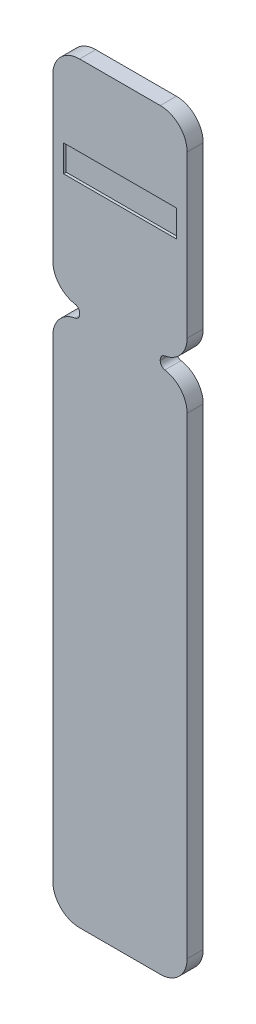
ISO-10303-21;
HEADER;
FILE_DESCRIPTION(('STEP AP214'),'2;1');
FILE_NAME('part.step','',(''),(''),'','','');
FILE_SCHEMA(('AUTOMOTIVE_DESIGN { 1 0 10303 214 1 1 1 1 }'));
ENDSEC;
DATA;
#1=APPLICATION_CONTEXT('core data for automotive mechanical design processes');
#2=APPLICATION_PROTOCOL_DEFINITION('international standard','automotive_design',2000,#1);
#3=PRODUCT_CONTEXT('',#1,'mechanical');
#4=PRODUCT('Part','Part','',(#3));
#5=PRODUCT_RELATED_PRODUCT_CATEGORY('part','',(#4));
#6=PRODUCT_DEFINITION_FORMATION('','',#4);
#7=PRODUCT_DEFINITION_CONTEXT('part definition',#1,'design');
#8=PRODUCT_DEFINITION('design','',#6,#7);
#9=PRODUCT_DEFINITION_SHAPE('','',#8);
#10=(LENGTH_UNIT() NAMED_UNIT(*) SI_UNIT(.MILLI.,.METRE.));
#11=(NAMED_UNIT(*) PLANE_ANGLE_UNIT() SI_UNIT($,.RADIAN.));
#12=(NAMED_UNIT(*) SI_UNIT($,.STERADIAN.) SOLID_ANGLE_UNIT());
#13=UNCERTAINTY_MEASURE_WITH_UNIT(LENGTH_MEASURE(1.E-05),#10,'distance_accuracy_value','');
#14=(GEOMETRIC_REPRESENTATION_CONTEXT(3) GLOBAL_UNCERTAINTY_ASSIGNED_CONTEXT((#13)) GLOBAL_UNIT_ASSIGNED_CONTEXT((#10,
#11,#12)) REPRESENTATION_CONTEXT('',''));
#15=CARTESIAN_POINT('',(0.,0.,0.));
#16=DIRECTION('',(0.,0.,1.));
#17=DIRECTION('',(1.,0.,0.));
#18=AXIS2_PLACEMENT_3D('',#15,#16,#17);
#19=CARTESIAN_POINT('',(-50.,60.,3.));
#20=DIRECTION('',(0.,-1.,0.));
#21=DIRECTION('',(0.,0.,-1.));
#22=AXIS2_PLACEMENT_3D('',#19,#20,#21);
#23=PLANE('',#22);
#24=DIRECTION('',(-1.,0.,0.));
#25=VECTOR('',#24,1.);
#26=CARTESIAN_POINT('',(-50.,60.,3.));
#27=LINE('',#26,#25);
#28=CARTESIAN_POINT('',(-30.,60.,3.));
#29=VERTEX_POINT('',#28);
#30=CARTESIAN_POINT('',(-45.,60.,3.));
#31=VERTEX_POINT('',#30);
#32=EDGE_CURVE('E249',#29,#31,#27,.T.);
#33=ORIENTED_EDGE('',*,*,#32,.F.);
#34=DIRECTION('',(0.,0.,-1.));
#35=VECTOR('',#34,1.);
#36=CARTESIAN_POINT('',(-30.,60.,3.));
#37=LINE('',#36,#35);
#38=CARTESIAN_POINT('',(-30.,60.,0.));
#39=VERTEX_POINT('',#38);
#40=EDGE_CURVE('E342',#29,#39,#37,.T.);
#41=ORIENTED_EDGE('',*,*,#40,.T.);
#42=DIRECTION('',(-1.,0.,0.));
#43=VECTOR('',#42,1.);
#44=CARTESIAN_POINT('',(-50.,60.,0.));
#45=LINE('',#44,#43);
#46=CARTESIAN_POINT('',(-45.,60.,0.));
#47=VERTEX_POINT('',#46);
#48=EDGE_CURVE('E225',#39,#47,#45,.T.);
#49=ORIENTED_EDGE('',*,*,#48,.T.);
#50=DIRECTION('',(0.,0.,-1.));
#51=VECTOR('',#50,1.);
#52=CARTESIAN_POINT('',(-45.,60.,3.));
#53=LINE('',#52,#51);
#54=EDGE_CURVE('E340',#47,#31,#53,.F.);
#55=ORIENTED_EDGE('',*,*,#54,.T.);
#56=EDGE_LOOP('',(#33,#41,#49,#55));
#57=FACE_BOUND('',#56,.T.);
#58=ADVANCED_FACE('F27',(#57),#23,.F.);
#59=CARTESIAN_POINT('',(-50.,60.,3.));
#60=DIRECTION('',(1.,0.,0.));
#61=DIRECTION('',(0.,1.,0.));
#62=AXIS2_PLACEMENT_3D('',#59,#60,#61);
#63=PLANE('',#62);
#64=DIRECTION('',(0.,-1.,0.));
#65=VECTOR('',#64,1.);
#66=CARTESIAN_POINT('',(-50.,60.,3.));
#67=LINE('',#66,#65);
#68=CARTESIAN_POINT('',(-50.,55.,3.));
#69=VERTEX_POINT('',#68);
#70=CARTESIAN_POINT('',(-50.,25.,3.));
#71=VERTEX_POINT('',#70);
#72=EDGE_CURVE('E252',#69,#71,#67,.T.);
#73=ORIENTED_EDGE('',*,*,#72,.F.);
#74=DIRECTION('',(0.,0.,-1.));
#75=VECTOR('',#74,1.);
#76=CARTESIAN_POINT('',(-50.,55.,3.));
#77=LINE('',#76,#75);
#78=CARTESIAN_POINT('',(-50.,55.,0.));
#79=VERTEX_POINT('',#78);
#80=EDGE_CURVE('E11',#69,#79,#77,.T.);
#81=ORIENTED_EDGE('',*,*,#80,.T.);
#82=DIRECTION('',(0.,-1.,0.));
#83=VECTOR('',#82,1.);
#84=CARTESIAN_POINT('',(-50.,60.,0.));
#85=LINE('',#84,#83);
#86=CARTESIAN_POINT('',(-50.,25.,0.));
#87=VERTEX_POINT('',#86);
#88=EDGE_CURVE('E230',#79,#87,#85,.T.);
#89=ORIENTED_EDGE('',*,*,#88,.T.);
#90=DIRECTION('',(0.,0.,-1.));
#91=VECTOR('',#90,1.);
#92=CARTESIAN_POINT('',(-50.,25.,3.));
#93=LINE('',#92,#91);
#94=EDGE_CURVE('E301',#87,#71,#93,.F.);
#95=ORIENTED_EDGE('',*,*,#94,.T.);
#96=EDGE_LOOP('',(#73,#81,#89,#95));
#97=FACE_BOUND('',#96,.T.);
#98=ADVANCED_FACE('F419',(#97),#63,.F.);
#99=CARTESIAN_POINT('',(-45.,20.,3.));
#100=DIRECTION('',(1.,0.,0.));
#101=DIRECTION('',(0.,0.,-1.));
#102=AXIS2_PLACEMENT_3D('',#99,#100,#101);
#103=PLANE('',#102);
#104=DIRECTION('',(0.,-1.,0.));
#105=VECTOR('',#104,1.);
#106=CARTESIAN_POINT('',(-45.,20.,0.));
#107=LINE('',#106,#105);
#108=CARTESIAN_POINT('',(-45.,19.0418123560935,0.));
#109=VERTEX_POINT('',#108);
#110=CARTESIAN_POINT('',(-45.,18.8581876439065,0.));
#111=VERTEX_POINT('',#110);
#112=EDGE_CURVE('E232',#109,#111,#107,.T.);
#113=ORIENTED_EDGE('',*,*,#112,.T.);
#114=DIRECTION('',(0.,0.,-1.));
#115=VECTOR('',#114,1.);
#116=CARTESIAN_POINT('',(-45.,18.8581876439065,3.));
#117=LINE('',#116,#115);
#118=CARTESIAN_POINT('',(-45.,18.8581876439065,3.));
#119=VERTEX_POINT('',#118);
#120=EDGE_CURVE('E320',#111,#119,#117,.F.);
#121=ORIENTED_EDGE('',*,*,#120,.T.);
#122=DIRECTION('',(0.,-1.,0.));
#123=VECTOR('',#122,1.);
#124=CARTESIAN_POINT('',(-45.,20.,3.));
#125=LINE('',#124,#123);
#126=CARTESIAN_POINT('',(-45.,19.0418123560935,3.));
#127=VERTEX_POINT('',#126);
#128=EDGE_CURVE('E254',#127,#119,#125,.T.);
#129=ORIENTED_EDGE('',*,*,#128,.F.);
#130=DIRECTION('',(0.,0.,-1.));
#131=VECTOR('',#130,1.);
#132=CARTESIAN_POINT('',(-45.,19.0418123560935,3.));
#133=LINE('',#132,#131);
#134=EDGE_CURVE('E317',#127,#109,#133,.T.);
#135=ORIENTED_EDGE('',*,*,#134,.T.);
#136=EDGE_LOOP('',(#113,#121,#129,#135));
#137=FACE_BOUND('',#136,.T.);
#138=ADVANCED_FACE('F434',(#137),#103,.F.);
#139=CARTESIAN_POINT('',(-50.,17.9,3.));
#140=DIRECTION('',(1.,0.,0.));
#141=DIRECTION('',(0.,0.,-1.));
#142=AXIS2_PLACEMENT_3D('',#139,#140,#141);
#143=PLANE('',#142);
#144=DIRECTION('',(0.,-1.,0.));
#145=VECTOR('',#144,1.);
#146=CARTESIAN_POINT('',(-50.,17.9,0.));
#147=LINE('',#146,#145);
#148=CARTESIAN_POINT('',(-50.,12.9,0.));
#149=VERTEX_POINT('',#148);
#150=CARTESIAN_POINT('',(-50.,-75.,0.));
#151=VERTEX_POINT('',#150);
#152=EDGE_CURVE('E235',#149,#151,#147,.T.);
#153=ORIENTED_EDGE('',*,*,#152,.T.);
#154=DIRECTION('',(0.,0.,-1.));
#155=VECTOR('',#154,1.);
#156=CARTESIAN_POINT('',(-50.,-75.,3.));
#157=LINE('',#156,#155);
#158=CARTESIAN_POINT('',(-50.,-75.,3.));
#159=VERTEX_POINT('',#158);
#160=EDGE_CURVE('E367',#151,#159,#157,.F.);
#161=ORIENTED_EDGE('',*,*,#160,.T.);
#162=DIRECTION('',(0.,-1.,0.));
#163=VECTOR('',#162,1.);
#164=CARTESIAN_POINT('',(-50.,17.9,3.));
#165=LINE('',#164,#163);
#166=CARTESIAN_POINT('',(-50.,12.9,3.));
#167=VERTEX_POINT('',#166);
#168=EDGE_CURVE('E257',#167,#159,#165,.T.);
#169=ORIENTED_EDGE('',*,*,#168,.F.);
#170=DIRECTION('',(0.,0.,-1.));
#171=VECTOR('',#170,1.);
#172=CARTESIAN_POINT('',(-50.,12.9,3.));
#173=LINE('',#172,#171);
#174=EDGE_CURVE('E298',#167,#149,#173,.T.);
#175=ORIENTED_EDGE('',*,*,#174,.T.);
#176=EDGE_LOOP('',(#153,#161,#169,#175));
#177=FACE_BOUND('',#176,.T.);
#178=ADVANCED_FACE('F448',(#177),#143,.F.);
#179=CARTESIAN_POINT('',(-50.,-80.,3.));
#180=DIRECTION('',(0.,1.,0.));
#181=DIRECTION('',(0.,0.,1.));
#182=AXIS2_PLACEMENT_3D('',#179,#180,#181);
#183=PLANE('',#182);
#184=DIRECTION('',(1.,0.,0.));
#185=VECTOR('',#184,1.);
#186=CARTESIAN_POINT('',(-50.,-80.,3.));
#187=LINE('',#186,#185);
#188=CARTESIAN_POINT('',(-45.,-80.,3.));
#189=VERTEX_POINT('',#188);
#190=CARTESIAN_POINT('',(-30.,-80.,3.));
#191=VERTEX_POINT('',#190);
#192=EDGE_CURVE('E260',#189,#191,#187,.T.);
#193=ORIENTED_EDGE('',*,*,#192,.F.);
#194=DIRECTION('',(0.,0.,-1.));
#195=VECTOR('',#194,1.);
#196=CARTESIAN_POINT('',(-45.,-80.,3.));
#197=LINE('',#196,#195);
#198=CARTESIAN_POINT('',(-45.,-80.,0.));
#199=VERTEX_POINT('',#198);
#200=EDGE_CURVE('E364',#189,#199,#197,.T.);
#201=ORIENTED_EDGE('',*,*,#200,.T.);
#202=DIRECTION('',(1.,0.,0.));
#203=VECTOR('',#202,1.);
#204=CARTESIAN_POINT('',(-50.,-80.,0.));
#205=LINE('',#204,#203);
#206=CARTESIAN_POINT('',(-30.,-80.,0.));
#207=VERTEX_POINT('',#206);
#208=EDGE_CURVE('E238',#199,#207,#205,.T.);
#209=ORIENTED_EDGE('',*,*,#208,.T.);
#210=DIRECTION('',(0.,0.,-1.));
#211=VECTOR('',#210,1.);
#212=CARTESIAN_POINT('',(-30.,-80.,3.));
#213=LINE('',#212,#211);
#214=EDGE_CURVE('E362',#207,#191,#213,.F.);
#215=ORIENTED_EDGE('',*,*,#214,.T.);
#216=EDGE_LOOP('',(#193,#201,#209,#215));
#217=FACE_BOUND('',#216,.T.);
#218=ADVANCED_FACE('F455',(#217),#183,.F.);
#219=CARTESIAN_POINT('',(-25.,17.9,3.));
#220=DIRECTION('',(-1.,0.,0.));
#221=DIRECTION('',(0.,-1.,0.));
#222=AXIS2_PLACEMENT_3D('',#219,#220,#221);
#223=PLANE('',#222);
#224=DIRECTION('',(0.,1.,0.));
#225=VECTOR('',#224,1.);
#226=CARTESIAN_POINT('',(-25.,17.9,3.));
#227=LINE('',#226,#225);
#228=CARTESIAN_POINT('',(-25.,-75.,3.));
#229=VERTEX_POINT('',#228);
#230=CARTESIAN_POINT('',(-25.,12.9,3.));
#231=VERTEX_POINT('',#230);
#232=EDGE_CURVE('E262',#229,#231,#227,.T.);
#233=ORIENTED_EDGE('',*,*,#232,.F.);
#234=DIRECTION('',(0.,0.,-1.));
#235=VECTOR('',#234,1.);
#236=CARTESIAN_POINT('',(-25.,-75.,3.));
#237=LINE('',#236,#235);
#238=CARTESIAN_POINT('',(-25.,-75.,0.));
#239=VERTEX_POINT('',#238);
#240=EDGE_CURVE('E34',#229,#239,#237,.T.);
#241=ORIENTED_EDGE('',*,*,#240,.T.);
#242=DIRECTION('',(0.,1.,0.));
#243=VECTOR('',#242,1.);
#244=CARTESIAN_POINT('',(-25.,17.9,0.));
#245=LINE('',#244,#243);
#246=CARTESIAN_POINT('',(-25.,12.9,0.));
#247=VERTEX_POINT('',#246);
#248=EDGE_CURVE('E241',#239,#247,#245,.T.);
#249=ORIENTED_EDGE('',*,*,#248,.T.);
#250=DIRECTION('',(0.,0.,-1.));
#251=VECTOR('',#250,1.);
#252=CARTESIAN_POINT('',(-25.,12.9,3.));
#253=LINE('',#252,#251);
#254=EDGE_CURVE('E295',#247,#231,#253,.F.);
#255=ORIENTED_EDGE('',*,*,#254,.T.);
#256=EDGE_LOOP('',(#233,#241,#249,#255));
#257=FACE_BOUND('',#256,.T.);
#258=ADVANCED_FACE('F372',(#257),#223,.F.);
#259=CARTESIAN_POINT('',(-30.,20.,3.));
#260=DIRECTION('',(-1.,0.,0.));
#261=DIRECTION('',(0.,0.,1.));
#262=AXIS2_PLACEMENT_3D('',#259,#260,#261);
#263=PLANE('',#262);
#264=DIRECTION('',(0.,1.,0.));
#265=VECTOR('',#264,1.);
#266=CARTESIAN_POINT('',(-30.,20.,3.));
#267=LINE('',#266,#265);
#268=CARTESIAN_POINT('',(-30.,18.8581876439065,3.));
#269=VERTEX_POINT('',#268);
#270=CARTESIAN_POINT('',(-30.,19.0418123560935,3.));
#271=VERTEX_POINT('',#270);
#272=EDGE_CURVE('E264',#269,#271,#267,.T.);
#273=ORIENTED_EDGE('',*,*,#272,.F.);
#274=DIRECTION('',(0.,0.,-1.));
#275=VECTOR('',#274,1.);
#276=CARTESIAN_POINT('',(-30.,18.8581876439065,3.));
#277=LINE('',#276,#275);
#278=CARTESIAN_POINT('',(-30.,18.8581876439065,0.));
#279=VERTEX_POINT('',#278);
#280=EDGE_CURVE('E306',#269,#279,#277,.T.);
#281=ORIENTED_EDGE('',*,*,#280,.T.);
#282=DIRECTION('',(0.,1.,0.));
#283=VECTOR('',#282,1.);
#284=CARTESIAN_POINT('',(-30.,20.,0.));
#285=LINE('',#284,#283);
#286=CARTESIAN_POINT('',(-30.,19.0418123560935,0.));
#287=VERTEX_POINT('',#286);
#288=EDGE_CURVE('E243',#279,#287,#285,.T.);
#289=ORIENTED_EDGE('',*,*,#288,.T.);
#290=DIRECTION('',(0.,0.,-1.));
#291=VECTOR('',#290,1.);
#292=CARTESIAN_POINT('',(-30.,19.0418123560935,3.));
#293=LINE('',#292,#291);
#294=EDGE_CURVE('E304',#287,#271,#293,.F.);
#295=ORIENTED_EDGE('',*,*,#294,.T.);
#296=EDGE_LOOP('',(#273,#281,#289,#295));
#297=FACE_BOUND('',#296,.T.);
#298=ADVANCED_FACE('F391',(#297),#263,.F.);
#299=CARTESIAN_POINT('',(-25.,60.,3.));
#300=DIRECTION('',(-1.,0.,0.));
#301=DIRECTION('',(0.,-1.,0.));
#302=AXIS2_PLACEMENT_3D('',#299,#300,#301);
#303=PLANE('',#302);
#304=DIRECTION('',(0.,1.,0.));
#305=VECTOR('',#304,1.);
#306=CARTESIAN_POINT('',(-25.,60.,0.));
#307=LINE('',#306,#305);
#308=CARTESIAN_POINT('',(-25.,25.,0.));
#309=VERTEX_POINT('',#308);
#310=CARTESIAN_POINT('',(-25.,55.,0.));
#311=VERTEX_POINT('',#310);
#312=EDGE_CURVE('E246',#309,#311,#307,.T.);
#313=ORIENTED_EDGE('',*,*,#312,.T.);
#314=DIRECTION('',(0.,0.,-1.));
#315=VECTOR('',#314,1.);
#316=CARTESIAN_POINT('',(-25.,55.,3.));
#317=LINE('',#316,#315);
#318=CARTESIAN_POINT('',(-25.,55.,3.));
#319=VERTEX_POINT('',#318);
#320=EDGE_CURVE('E353',#311,#319,#317,.F.);
#321=ORIENTED_EDGE('',*,*,#320,.T.);
#322=DIRECTION('',(0.,1.,0.));
#323=VECTOR('',#322,1.);
#324=CARTESIAN_POINT('',(-25.,60.,3.));
#325=LINE('',#324,#323);
#326=CARTESIAN_POINT('',(-25.,25.,3.));
#327=VERTEX_POINT('',#326);
#328=EDGE_CURVE('E267',#327,#319,#325,.T.);
#329=ORIENTED_EDGE('',*,*,#328,.F.);
#330=DIRECTION('',(0.,0.,-1.));
#331=VECTOR('',#330,1.);
#332=CARTESIAN_POINT('',(-25.,25.,3.));
#333=LINE('',#332,#331);
#334=EDGE_CURVE('E270',#327,#309,#333,.T.);
#335=ORIENTED_EDGE('',*,*,#334,.T.);
#336=EDGE_LOOP('',(#313,#321,#329,#335));
#337=FACE_BOUND('',#336,.T.);
#338=ADVANCED_FACE('F405',(#337),#303,.F.);
#339=CARTESIAN_POINT('',(-30.,60.,3.));
#340=DIRECTION('',(0.,0.,-1.));
#341=DIRECTION('',(-1.,0.,0.));
#342=AXIS2_PLACEMENT_3D('',#339,#340,#341);
#343=PLANE('',#342);
#344=DIRECTION('',(1.,0.,0.));
#345=VECTOR('',#344,1.);
#346=CARTESIAN_POINT('',(-48.,40.,3.));
#347=LINE('',#346,#345);
#348=CARTESIAN_POINT('',(-48.,40.,3.));
#349=VERTEX_POINT('',#348);
#350=CARTESIAN_POINT('',(-27.,40.,3.));
#351=VERTEX_POINT('',#350);
#352=EDGE_CURVE('E203',#349,#351,#347,.T.);
#353=ORIENTED_EDGE('',*,*,#352,.F.);
#354=DIRECTION('',(0.,-1.,0.));
#355=VECTOR('',#354,1.);
#356=CARTESIAN_POINT('',(-48.,45.,3.));
#357=LINE('',#356,#355);
#358=CARTESIAN_POINT('',(-48.,45.,3.));
#359=VERTEX_POINT('',#358);
#360=EDGE_CURVE('E41',#359,#349,#357,.T.);
#361=ORIENTED_EDGE('',*,*,#360,.F.);
#362=DIRECTION('',(-1.,0.,0.));
#363=VECTOR('',#362,1.);
#364=CARTESIAN_POINT('',(-48.,45.,3.));
#365=LINE('',#364,#363);
#366=CARTESIAN_POINT('',(-27.,45.,3.));
#367=VERTEX_POINT('',#366);
#368=EDGE_CURVE('E209',#367,#359,#365,.T.);
#369=ORIENTED_EDGE('',*,*,#368,.F.);
#370=DIRECTION('',(0.,1.,0.));
#371=VECTOR('',#370,1.);
#372=CARTESIAN_POINT('',(-27.,45.,3.));
#373=LINE('',#372,#371);
#374=EDGE_CURVE('E192',#351,#367,#373,.T.);
#375=ORIENTED_EDGE('',*,*,#374,.F.);
#376=EDGE_LOOP('',(#353,#361,#369,#375));
#377=FACE_BOUND('',#376,.T.);
#378=ORIENTED_EDGE('',*,*,#328,.T.);
#379=CARTESIAN_POINT('',(-30.,55.,3.));
#380=DIRECTION('',(0.,0.,-1.));
#381=DIRECTION('',(-1.,0.,0.));
#382=AXIS2_PLACEMENT_3D('',#379,#380,#381);
#383=CIRCLE('',#382,5.);
#384=EDGE_CURVE('E360',#319,#29,#383,.F.);
#385=ORIENTED_EDGE('',*,*,#384,.T.);
#386=ORIENTED_EDGE('',*,*,#32,.T.);
#387=CARTESIAN_POINT('',(-45.,55.,3.));
#388=DIRECTION('',(0.,0.,-1.));
#389=DIRECTION('',(-1.,0.,0.));
#390=AXIS2_PLACEMENT_3D('',#387,#388,#389);
#391=CIRCLE('',#390,5.);
#392=EDGE_CURVE('E355',#31,#69,#391,.F.);
#393=ORIENTED_EDGE('',*,*,#392,.T.);
#394=ORIENTED_EDGE('',*,*,#72,.T.);
#395=CARTESIAN_POINT('',(-45.,25.,3.));
#396=DIRECTION('',(0.,0.,-1.));
#397=DIRECTION('',(-1.,0.,0.));
#398=AXIS2_PLACEMENT_3D('',#395,#396,#397);
#399=CIRCLE('',#398,5.);
#400=CARTESIAN_POINT('',(-45.8677685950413,20.0758779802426,3.));
#401=VERTEX_POINT('',#400);
#402=EDGE_CURVE('E285',#71,#401,#399,.F.);
#403=ORIENTED_EDGE('',*,*,#402,.T.);
#404=CARTESIAN_POINT('',(-46.05,19.0418123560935,3.));
#405=DIRECTION('',(0.,0.,-1.));
#406=DIRECTION('',(-1.,0.,0.));
#407=AXIS2_PLACEMENT_3D('',#404,#405,#406);
#408=CIRCLE('',#407,1.05);
#409=EDGE_CURVE('E338',#401,#127,#408,.T.);
#410=ORIENTED_EDGE('',*,*,#409,.T.);
#411=ORIENTED_EDGE('',*,*,#128,.T.);
#412=CARTESIAN_POINT('',(-46.05,18.8581876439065,3.));
#413=DIRECTION('',(0.,0.,-1.));
#414=DIRECTION('',(-1.,0.,0.));
#415=AXIS2_PLACEMENT_3D('',#412,#413,#414);
#416=CIRCLE('',#415,1.05);
#417=CARTESIAN_POINT('',(-45.8677685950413,17.8241220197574,3.));
#418=VERTEX_POINT('',#417);
#419=EDGE_CURVE('E334',#119,#418,#416,.T.);
#420=ORIENTED_EDGE('',*,*,#419,.T.);
#421=CARTESIAN_POINT('',(-45.,12.9,3.));
#422=DIRECTION('',(0.,0.,-1.));
#423=DIRECTION('',(-1.,0.,0.));
#424=AXIS2_PLACEMENT_3D('',#421,#422,#423);
#425=CIRCLE('',#424,5.);
#426=EDGE_CURVE('E288',#418,#167,#425,.F.);
#427=ORIENTED_EDGE('',*,*,#426,.T.);
#428=ORIENTED_EDGE('',*,*,#168,.T.);
#429=CARTESIAN_POINT('',(-45.,-75.,3.));
#430=DIRECTION('',(0.,0.,-1.));
#431=DIRECTION('',(-1.,0.,0.));
#432=AXIS2_PLACEMENT_3D('',#429,#430,#431);
#433=CIRCLE('',#432,5.);
#434=EDGE_CURVE('E358',#159,#189,#433,.F.);
#435=ORIENTED_EDGE('',*,*,#434,.T.);
#436=ORIENTED_EDGE('',*,*,#192,.T.);
#437=CARTESIAN_POINT('',(-30.,-75.,3.));
#438=DIRECTION('',(0.,0.,-1.));
#439=DIRECTION('',(-1.,0.,0.));
#440=AXIS2_PLACEMENT_3D('',#437,#438,#439);
#441=CIRCLE('',#440,5.);
#442=EDGE_CURVE('E49',#191,#229,#441,.F.);
#443=ORIENTED_EDGE('',*,*,#442,.T.);
#444=ORIENTED_EDGE('',*,*,#232,.T.);
#445=CARTESIAN_POINT('',(-30.,12.9,3.));
#446=DIRECTION('',(0.,0.,-1.));
#447=DIRECTION('',(-1.,0.,0.));
#448=AXIS2_PLACEMENT_3D('',#445,#446,#447);
#449=CIRCLE('',#448,5.);
#450=CARTESIAN_POINT('',(-29.1322314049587,17.8241220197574,3.));
#451=VERTEX_POINT('',#450);
#452=EDGE_CURVE('E290',#231,#451,#449,.F.);
#453=ORIENTED_EDGE('',*,*,#452,.T.);
#454=CARTESIAN_POINT('',(-28.95,18.8581876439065,3.));
#455=DIRECTION('',(0.,0.,-1.));
#456=DIRECTION('',(-1.,0.,0.));
#457=AXIS2_PLACEMENT_3D('',#454,#455,#456);
#458=CIRCLE('',#457,1.05);
#459=EDGE_CURVE('E326',#451,#269,#458,.T.);
#460=ORIENTED_EDGE('',*,*,#459,.T.);
#461=ORIENTED_EDGE('',*,*,#272,.T.);
#462=CARTESIAN_POINT('',(-28.95,19.0418123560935,3.));
#463=DIRECTION('',(0.,0.,-1.));
#464=DIRECTION('',(-1.,0.,0.));
#465=AXIS2_PLACEMENT_3D('',#462,#463,#464);
#466=CIRCLE('',#465,1.05);
#467=CARTESIAN_POINT('',(-29.1322314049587,20.0758779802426,3.));
#468=VERTEX_POINT('',#467);
#469=EDGE_CURVE('E330',#271,#468,#466,.T.);
#470=ORIENTED_EDGE('',*,*,#469,.T.);
#471=CARTESIAN_POINT('',(-30.,25.,3.));
#472=DIRECTION('',(0.,0.,-1.));
#473=DIRECTION('',(-1.,0.,0.));
#474=AXIS2_PLACEMENT_3D('',#471,#472,#473);
#475=CIRCLE('',#474,5.);
#476=EDGE_CURVE('E293',#468,#327,#475,.F.);
#477=ORIENTED_EDGE('',*,*,#476,.T.);
#478=EDGE_LOOP('',(#378,#385,#386,#393,#394,#403,#410,#411,#420,#427,#428,#435,#436,#443,#444,
#453,#460,#461,#470,#477));
#479=FACE_BOUND('',#478,.T.);
#480=ADVANCED_FACE('F207',(#377,#479),#343,.F.);
#481=CARTESIAN_POINT('',(-30.,60.,0.));
#482=DIRECTION('',(0.,0.,-1.));
#483=DIRECTION('',(-1.,0.,0.));
#484=AXIS2_PLACEMENT_3D('',#481,#482,#483);
#485=PLANE('',#484);
#486=ORIENTED_EDGE('',*,*,#48,.F.);
#487=CARTESIAN_POINT('',(-30.,55.,0.));
#488=DIRECTION('',(0.,0.,-1.));
#489=DIRECTION('',(-1.,0.,0.));
#490=AXIS2_PLACEMENT_3D('',#487,#488,#489);
#491=CIRCLE('',#490,5.);
#492=EDGE_CURVE('E351',#39,#311,#491,.T.);
#493=ORIENTED_EDGE('',*,*,#492,.T.);
#494=ORIENTED_EDGE('',*,*,#312,.F.);
#495=CARTESIAN_POINT('',(-30.,25.,0.));
#496=DIRECTION('',(0.,0.,-1.));
#497=DIRECTION('',(-1.,0.,0.));
#498=AXIS2_PLACEMENT_3D('',#495,#496,#497);
#499=CIRCLE('',#498,5.);
#500=CARTESIAN_POINT('',(-29.1322314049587,20.0758779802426,0.));
#501=VERTEX_POINT('',#500);
#502=EDGE_CURVE('E282',#309,#501,#499,.T.);
#503=ORIENTED_EDGE('',*,*,#502,.T.);
#504=CARTESIAN_POINT('',(-28.95,19.0418123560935,0.));
#505=DIRECTION('',(0.,0.,-1.));
#506=DIRECTION('',(-1.,0.,0.));
#507=AXIS2_PLACEMENT_3D('',#504,#505,#506);
#508=CIRCLE('',#507,1.05);
#509=EDGE_CURVE('E328',#501,#287,#508,.F.);
#510=ORIENTED_EDGE('',*,*,#509,.T.);
#511=ORIENTED_EDGE('',*,*,#288,.F.);
#512=CARTESIAN_POINT('',(-28.95,18.8581876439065,0.));
#513=DIRECTION('',(0.,0.,-1.));
#514=DIRECTION('',(-1.,0.,0.));
#515=AXIS2_PLACEMENT_3D('',#512,#513,#514);
#516=CIRCLE('',#515,1.05);
#517=CARTESIAN_POINT('',(-29.1322314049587,17.8241220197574,0.));
#518=VERTEX_POINT('',#517);
#519=EDGE_CURVE('E324',#279,#518,#516,.F.);
#520=ORIENTED_EDGE('',*,*,#519,.T.);
#521=CARTESIAN_POINT('',(-30.,12.9,0.));
#522=DIRECTION('',(0.,0.,-1.));
#523=DIRECTION('',(-1.,0.,0.));
#524=AXIS2_PLACEMENT_3D('',#521,#522,#523);
#525=CIRCLE('',#524,5.);
#526=EDGE_CURVE('E279',#518,#247,#525,.T.);
#527=ORIENTED_EDGE('',*,*,#526,.T.);
#528=ORIENTED_EDGE('',*,*,#248,.F.);
#529=CARTESIAN_POINT('',(-30.,-75.,0.));
#530=DIRECTION('',(0.,0.,-1.));
#531=DIRECTION('',(-1.,0.,0.));
#532=AXIS2_PLACEMENT_3D('',#529,#530,#531);
#533=CIRCLE('',#532,5.);
#534=EDGE_CURVE('E347',#239,#207,#533,.T.);
#535=ORIENTED_EDGE('',*,*,#534,.T.);
#536=ORIENTED_EDGE('',*,*,#208,.F.);
#537=CARTESIAN_POINT('',(-45.,-75.,0.));
#538=DIRECTION('',(0.,0.,-1.));
#539=DIRECTION('',(-1.,0.,0.));
#540=AXIS2_PLACEMENT_3D('',#537,#538,#539);
#541=CIRCLE('',#540,5.);
#542=EDGE_CURVE('E349',#199,#151,#541,.T.);
#543=ORIENTED_EDGE('',*,*,#542,.T.);
#544=ORIENTED_EDGE('',*,*,#152,.F.);
#545=CARTESIAN_POINT('',(-45.,12.9,0.));
#546=DIRECTION('',(0.,0.,-1.));
#547=DIRECTION('',(-1.,0.,0.));
#548=AXIS2_PLACEMENT_3D('',#545,#546,#547);
#549=CIRCLE('',#548,5.);
#550=CARTESIAN_POINT('',(-45.8677685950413,17.8241220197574,0.));
#551=VERTEX_POINT('',#550);
#552=EDGE_CURVE('E276',#149,#551,#549,.T.);
#553=ORIENTED_EDGE('',*,*,#552,.T.);
#554=CARTESIAN_POINT('',(-46.05,18.8581876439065,0.));
#555=DIRECTION('',(0.,0.,-1.));
#556=DIRECTION('',(-1.,0.,0.));
#557=AXIS2_PLACEMENT_3D('',#554,#555,#556);
#558=CIRCLE('',#557,1.05);
#559=EDGE_CURVE('E332',#551,#111,#558,.F.);
#560=ORIENTED_EDGE('',*,*,#559,.T.);
#561=ORIENTED_EDGE('',*,*,#112,.F.);
#562=CARTESIAN_POINT('',(-46.05,19.0418123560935,0.));
#563=DIRECTION('',(0.,0.,-1.));
#564=DIRECTION('',(-1.,0.,0.));
#565=AXIS2_PLACEMENT_3D('',#562,#563,#564);
#566=CIRCLE('',#565,1.05);
#567=CARTESIAN_POINT('',(-45.8677685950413,20.0758779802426,0.));
#568=VERTEX_POINT('',#567);
#569=EDGE_CURVE('E336',#109,#568,#566,.F.);
#570=ORIENTED_EDGE('',*,*,#569,.T.);
#571=CARTESIAN_POINT('',(-45.,25.,0.));
#572=DIRECTION('',(0.,0.,-1.));
#573=DIRECTION('',(-1.,0.,0.));
#574=AXIS2_PLACEMENT_3D('',#571,#572,#573);
#575=CIRCLE('',#574,5.);
#576=EDGE_CURVE('E273',#568,#87,#575,.T.);
#577=ORIENTED_EDGE('',*,*,#576,.T.);
#578=ORIENTED_EDGE('',*,*,#88,.F.);
#579=CARTESIAN_POINT('',(-45.,55.,0.));
#580=DIRECTION('',(0.,0.,-1.));
#581=DIRECTION('',(-1.,0.,0.));
#582=AXIS2_PLACEMENT_3D('',#579,#580,#581);
#583=CIRCLE('',#582,5.);
#584=EDGE_CURVE('E345',#79,#47,#583,.T.);
#585=ORIENTED_EDGE('',*,*,#584,.T.);
#586=EDGE_LOOP('',(#486,#493,#494,#503,#510,#511,#520,#527,#528,#535,#536,#543,#544,#553,#560,
#561,#570,#577,#578,#585));
#587=FACE_BOUND('',#586,.T.);
#588=ADVANCED_FACE('F376',(#587),#485,.T.);
#589=CARTESIAN_POINT('',(-30.,25.,3.));
#590=DIRECTION('',(0.,0.,-1.));
#591=DIRECTION('',(-1.,0.,0.));
#592=AXIS2_PLACEMENT_3D('',#589,#590,#591);
#593=CYLINDRICAL_SURFACE('',#592,5.);
#594=ORIENTED_EDGE('',*,*,#476,.F.);
#595=DIRECTION('',(0.,0.,-1.));
#596=VECTOR('',#595,1.);
#597=CARTESIAN_POINT('',(-29.1322314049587,20.0758779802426,3.));
#598=LINE('',#597,#596);
#599=EDGE_CURVE('E311',#468,#501,#598,.T.);
#600=ORIENTED_EDGE('',*,*,#599,.T.);
#601=ORIENTED_EDGE('',*,*,#502,.F.);
#602=ORIENTED_EDGE('',*,*,#334,.F.);
#603=EDGE_LOOP('',(#594,#600,#601,#602));
#604=FACE_BOUND('',#603,.T.);
#605=ADVANCED_FACE('F400',(#604),#593,.T.);
#606=CARTESIAN_POINT('',(-30.,12.9,3.));
#607=DIRECTION('',(0.,0.,-1.));
#608=DIRECTION('',(-1.,0.,0.));
#609=AXIS2_PLACEMENT_3D('',#606,#607,#608);
#610=CYLINDRICAL_SURFACE('',#609,5.);
#611=ORIENTED_EDGE('',*,*,#526,.F.);
#612=DIRECTION('',(0.,0.,-1.));
#613=VECTOR('',#612,1.);
#614=CARTESIAN_POINT('',(-29.1322314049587,17.8241220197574,3.));
#615=LINE('',#614,#613);
#616=EDGE_CURVE('E309',#518,#451,#615,.F.);
#617=ORIENTED_EDGE('',*,*,#616,.T.);
#618=ORIENTED_EDGE('',*,*,#452,.F.);
#619=ORIENTED_EDGE('',*,*,#254,.F.);
#620=EDGE_LOOP('',(#611,#617,#618,#619));
#621=FACE_BOUND('',#620,.T.);
#622=ADVANCED_FACE('F384',(#621),#610,.T.);
#623=CARTESIAN_POINT('',(-45.,12.9,3.));
#624=DIRECTION('',(0.,0.,-1.));
#625=DIRECTION('',(-1.,0.,0.));
#626=AXIS2_PLACEMENT_3D('',#623,#624,#625);
#627=CYLINDRICAL_SURFACE('',#626,5.);
#628=ORIENTED_EDGE('',*,*,#426,.F.);
#629=DIRECTION('',(0.,0.,-1.));
#630=VECTOR('',#629,1.);
#631=CARTESIAN_POINT('',(-45.8677685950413,17.8241220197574,3.));
#632=LINE('',#631,#630);
#633=EDGE_CURVE('E314',#418,#551,#632,.T.);
#634=ORIENTED_EDGE('',*,*,#633,.T.);
#635=ORIENTED_EDGE('',*,*,#552,.F.);
#636=ORIENTED_EDGE('',*,*,#174,.F.);
#637=EDGE_LOOP('',(#628,#634,#635,#636));
#638=FACE_BOUND('',#637,.T.);
#639=ADVANCED_FACE('F443',(#638),#627,.T.);
#640=CARTESIAN_POINT('',(-45.,25.,3.));
#641=DIRECTION('',(0.,0.,-1.));
#642=DIRECTION('',(-1.,0.,0.));
#643=AXIS2_PLACEMENT_3D('',#640,#641,#642);
#644=CYLINDRICAL_SURFACE('',#643,5.);
#645=ORIENTED_EDGE('',*,*,#576,.F.);
#646=DIRECTION('',(0.,0.,-1.));
#647=VECTOR('',#646,1.);
#648=CARTESIAN_POINT('',(-45.8677685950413,20.0758779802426,3.));
#649=LINE('',#648,#647);
#650=EDGE_CURVE('E322',#568,#401,#649,.F.);
#651=ORIENTED_EDGE('',*,*,#650,.T.);
#652=ORIENTED_EDGE('',*,*,#402,.F.);
#653=ORIENTED_EDGE('',*,*,#94,.F.);
#654=EDGE_LOOP('',(#645,#651,#652,#653));
#655=FACE_BOUND('',#654,.T.);
#656=ADVANCED_FACE('F425',(#655),#644,.T.);
#657=CARTESIAN_POINT('',(-28.95,18.8581876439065,3.));
#658=DIRECTION('',(0.,0.,-1.));
#659=DIRECTION('',(-1.,0.,0.));
#660=AXIS2_PLACEMENT_3D('',#657,#658,#659);
#661=CYLINDRICAL_SURFACE('',#660,1.05);
#662=ORIENTED_EDGE('',*,*,#459,.F.);
#663=ORIENTED_EDGE('',*,*,#616,.F.);
#664=ORIENTED_EDGE('',*,*,#519,.F.);
#665=ORIENTED_EDGE('',*,*,#280,.F.);
#666=EDGE_LOOP('',(#662,#663,#664,#665));
#667=FACE_BOUND('',#666,.T.);
#668=ADVANCED_FACE('F389',(#667),#661,.F.);
#669=CARTESIAN_POINT('',(-28.95,19.0418123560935,3.));
#670=DIRECTION('',(0.,0.,-1.));
#671=DIRECTION('',(-1.,0.,0.));
#672=AXIS2_PLACEMENT_3D('',#669,#670,#671);
#673=CYLINDRICAL_SURFACE('',#672,1.05);
#674=ORIENTED_EDGE('',*,*,#469,.F.);
#675=ORIENTED_EDGE('',*,*,#294,.F.);
#676=ORIENTED_EDGE('',*,*,#509,.F.);
#677=ORIENTED_EDGE('',*,*,#599,.F.);
#678=EDGE_LOOP('',(#674,#675,#676,#677));
#679=FACE_BOUND('',#678,.T.);
#680=ADVANCED_FACE('F397',(#679),#673,.F.);
#681=CARTESIAN_POINT('',(-46.05,18.8581876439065,3.));
#682=DIRECTION('',(0.,0.,-1.));
#683=DIRECTION('',(-1.,0.,0.));
#684=AXIS2_PLACEMENT_3D('',#681,#682,#683);
#685=CYLINDRICAL_SURFACE('',#684,1.05);
#686=ORIENTED_EDGE('',*,*,#419,.F.);
#687=ORIENTED_EDGE('',*,*,#120,.F.);
#688=ORIENTED_EDGE('',*,*,#559,.F.);
#689=ORIENTED_EDGE('',*,*,#633,.F.);
#690=EDGE_LOOP('',(#686,#687,#688,#689));
#691=FACE_BOUND('',#690,.T.);
#692=ADVANCED_FACE('F440',(#691),#685,.F.);
#693=CARTESIAN_POINT('',(-46.05,19.0418123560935,3.));
#694=DIRECTION('',(0.,0.,-1.));
#695=DIRECTION('',(-1.,0.,0.));
#696=AXIS2_PLACEMENT_3D('',#693,#694,#695);
#697=CYLINDRICAL_SURFACE('',#696,1.05);
#698=ORIENTED_EDGE('',*,*,#409,.F.);
#699=ORIENTED_EDGE('',*,*,#650,.F.);
#700=ORIENTED_EDGE('',*,*,#569,.F.);
#701=ORIENTED_EDGE('',*,*,#134,.F.);
#702=EDGE_LOOP('',(#698,#699,#700,#701));
#703=FACE_BOUND('',#702,.T.);
#704=ADVANCED_FACE('F431',(#703),#697,.F.);
#705=CARTESIAN_POINT('',(-30.,55.,3.));
#706=DIRECTION('',(0.,0.,-1.));
#707=DIRECTION('',(-1.,0.,0.));
#708=AXIS2_PLACEMENT_3D('',#705,#706,#707);
#709=CYLINDRICAL_SURFACE('',#708,5.);
#710=ORIENTED_EDGE('',*,*,#384,.F.);
#711=ORIENTED_EDGE('',*,*,#320,.F.);
#712=ORIENTED_EDGE('',*,*,#492,.F.);
#713=ORIENTED_EDGE('',*,*,#40,.F.);
#714=EDGE_LOOP('',(#710,#711,#712,#713));
#715=FACE_BOUND('',#714,.T.);
#716=ADVANCED_FACE('F408',(#715),#709,.T.);
#717=CARTESIAN_POINT('',(-45.,-75.,3.));
#718=DIRECTION('',(0.,0.,-1.));
#719=DIRECTION('',(-1.,0.,0.));
#720=AXIS2_PLACEMENT_3D('',#717,#718,#719);
#721=CYLINDRICAL_SURFACE('',#720,5.);
#722=ORIENTED_EDGE('',*,*,#434,.F.);
#723=ORIENTED_EDGE('',*,*,#160,.F.);
#724=ORIENTED_EDGE('',*,*,#542,.F.);
#725=ORIENTED_EDGE('',*,*,#200,.F.);
#726=EDGE_LOOP('',(#722,#723,#724,#725));
#727=FACE_BOUND('',#726,.T.);
#728=ADVANCED_FACE('F451',(#727),#721,.T.);
#729=CARTESIAN_POINT('',(-30.,-75.,3.));
#730=DIRECTION('',(0.,0.,-1.));
#731=DIRECTION('',(-1.,0.,0.));
#732=AXIS2_PLACEMENT_3D('',#729,#730,#731);
#733=CYLINDRICAL_SURFACE('',#732,5.);
#734=ORIENTED_EDGE('',*,*,#442,.F.);
#735=ORIENTED_EDGE('',*,*,#214,.F.);
#736=ORIENTED_EDGE('',*,*,#534,.F.);
#737=ORIENTED_EDGE('',*,*,#240,.F.);
#738=EDGE_LOOP('',(#734,#735,#736,#737));
#739=FACE_BOUND('',#738,.T.);
#740=ADVANCED_FACE('F457',(#739),#733,.T.);
#741=CARTESIAN_POINT('',(-45.,55.,3.));
#742=DIRECTION('',(0.,0.,-1.));
#743=DIRECTION('',(-1.,0.,0.));
#744=AXIS2_PLACEMENT_3D('',#741,#742,#743);
#745=CYLINDRICAL_SURFACE('',#744,5.);
#746=ORIENTED_EDGE('',*,*,#392,.F.);
#747=ORIENTED_EDGE('',*,*,#54,.F.);
#748=ORIENTED_EDGE('',*,*,#584,.F.);
#749=ORIENTED_EDGE('',*,*,#80,.F.);
#750=EDGE_LOOP('',(#746,#747,#748,#749));
#751=FACE_BOUND('',#750,.T.);
#752=ADVANCED_FACE('F415',(#751),#745,.T.);
#753=CARTESIAN_POINT('',(-48.,45.,2.5));
#754=DIRECTION('',(-1.,0.,0.));
#755=DIRECTION('',(0.,0.,1.));
#756=AXIS2_PLACEMENT_3D('',#753,#754,#755);
#757=PLANE('',#756);
#758=ORIENTED_EDGE('',*,*,#360,.T.);
#759=DIRECTION('',(0.,0.,1.));
#760=VECTOR('',#759,1.);
#761=CARTESIAN_POINT('',(-48.,40.,2.5));
#762=LINE('',#761,#760);
#763=CARTESIAN_POINT('',(-48.,40.,2.5));
#764=VERTEX_POINT('',#763);
#765=EDGE_CURVE('E200',#764,#349,#762,.T.);
#766=ORIENTED_EDGE('',*,*,#765,.F.);
#767=DIRECTION('',(0.,-1.,0.));
#768=VECTOR('',#767,1.);
#769=CARTESIAN_POINT('',(-48.,45.,2.5));
#770=LINE('',#769,#768);
#771=CARTESIAN_POINT('',(-48.,45.,2.5));
#772=VERTEX_POINT('',#771);
#773=EDGE_CURVE('E211',#772,#764,#770,.T.);
#774=ORIENTED_EDGE('',*,*,#773,.F.);
#775=DIRECTION('',(0.,0.,1.));
#776=VECTOR('',#775,1.);
#777=CARTESIAN_POINT('',(-48.,45.,2.5));
#778=LINE('',#777,#776);
#779=EDGE_CURVE('E223',#772,#359,#778,.T.);
#780=ORIENTED_EDGE('',*,*,#779,.T.);
#781=EDGE_LOOP('',(#758,#766,#774,#780));
#782=FACE_BOUND('',#781,.T.);
#783=ADVANCED_FACE('F464',(#782),#757,.F.);
#784=CARTESIAN_POINT('',(-48.,45.,2.5));
#785=DIRECTION('',(0.,1.,0.));
#786=DIRECTION('',(0.,0.,1.));
#787=AXIS2_PLACEMENT_3D('',#784,#785,#786);
#788=PLANE('',#787);
#789=ORIENTED_EDGE('',*,*,#368,.T.);
#790=ORIENTED_EDGE('',*,*,#779,.F.);
#791=DIRECTION('',(-1.,0.,0.));
#792=VECTOR('',#791,1.);
#793=CARTESIAN_POINT('',(-48.,45.,2.5));
#794=LINE('',#793,#792);
#795=CARTESIAN_POINT('',(-27.,45.,2.5));
#796=VERTEX_POINT('',#795);
#797=EDGE_CURVE('E220',#796,#772,#794,.T.);
#798=ORIENTED_EDGE('',*,*,#797,.F.);
#799=DIRECTION('',(0.,0.,1.));
#800=VECTOR('',#799,1.);
#801=CARTESIAN_POINT('',(-27.,45.,2.5));
#802=LINE('',#801,#800);
#803=EDGE_CURVE('E199',#796,#367,#802,.T.);
#804=ORIENTED_EDGE('',*,*,#803,.T.);
#805=EDGE_LOOP('',(#789,#790,#798,#804));
#806=FACE_BOUND('',#805,.T.);
#807=ADVANCED_FACE('F529',(#806),#788,.F.);
#808=CARTESIAN_POINT('',(-27.,45.,2.5));
#809=DIRECTION('',(1.,0.,0.));
#810=DIRECTION('',(0.,0.,-1.));
#811=AXIS2_PLACEMENT_3D('',#808,#809,#810);
#812=PLANE('',#811);
#813=ORIENTED_EDGE('',*,*,#374,.T.);
#814=ORIENTED_EDGE('',*,*,#803,.F.);
#815=DIRECTION('',(0.,1.,0.));
#816=VECTOR('',#815,1.);
#817=CARTESIAN_POINT('',(-27.,45.,2.5));
#818=LINE('',#817,#816);
#819=CARTESIAN_POINT('',(-27.,40.,2.5));
#820=VERTEX_POINT('',#819);
#821=EDGE_CURVE('E195',#820,#796,#818,.T.);
#822=ORIENTED_EDGE('',*,*,#821,.F.);
#823=DIRECTION('',(0.,0.,1.));
#824=VECTOR('',#823,1.);
#825=CARTESIAN_POINT('',(-27.,40.,2.5));
#826=LINE('',#825,#824);
#827=EDGE_CURVE('E188',#820,#351,#826,.T.);
#828=ORIENTED_EDGE('',*,*,#827,.T.);
#829=EDGE_LOOP('',(#813,#814,#822,#828));
#830=FACE_BOUND('',#829,.T.);
#831=ADVANCED_FACE('F190',(#830),#812,.F.);
#832=CARTESIAN_POINT('',(-48.,40.,2.5));
#833=DIRECTION('',(0.,-1.,0.));
#834=DIRECTION('',(0.,0.,-1.));
#835=AXIS2_PLACEMENT_3D('',#832,#833,#834);
#836=PLANE('',#835);
#837=ORIENTED_EDGE('',*,*,#352,.T.);
#838=ORIENTED_EDGE('',*,*,#827,.F.);
#839=DIRECTION('',(1.,0.,0.));
#840=VECTOR('',#839,1.);
#841=CARTESIAN_POINT('',(-48.,40.,2.5));
#842=LINE('',#841,#840);
#843=EDGE_CURVE('E217',#764,#820,#842,.T.);
#844=ORIENTED_EDGE('',*,*,#843,.F.);
#845=ORIENTED_EDGE('',*,*,#765,.T.);
#846=EDGE_LOOP('',(#837,#838,#844,#845));
#847=FACE_BOUND('',#846,.T.);
#848=ADVANCED_FACE('F204',(#847),#836,.F.);
#849=CARTESIAN_POINT('',(-48.,40.,2.5));
#850=DIRECTION('',(0.,0.,1.));
#851=DIRECTION('',(1.,0.,0.));
#852=AXIS2_PLACEMENT_3D('',#849,#850,#851);
#853=PLANE('',#852);
#854=ORIENTED_EDGE('',*,*,#773,.T.);
#855=ORIENTED_EDGE('',*,*,#843,.T.);
#856=ORIENTED_EDGE('',*,*,#821,.T.);
#857=ORIENTED_EDGE('',*,*,#797,.T.);
#858=EDGE_LOOP('',(#854,#855,#856,#857));
#859=FACE_BOUND('',#858,.T.);
#860=ADVANCED_FACE('F549',(#859),#853,.T.);
#861=CLOSED_SHELL('',(#58,#98,#138,#178,#218,#258,#298,#338,#480,#588,#605,#622,#639,#656,#668,
#680,#692,#704,#716,#728,#740,#752,#783,#807,#831,#848,#860));
#862=MANIFOLD_SOLID_BREP('B2',#861);
#863=ADVANCED_BREP_SHAPE_REPRESENTATION('',(#18,#862),#14);
#864=SHAPE_DEFINITION_REPRESENTATION(#9,#863);
ENDSEC;
END-ISO-10303-21;
